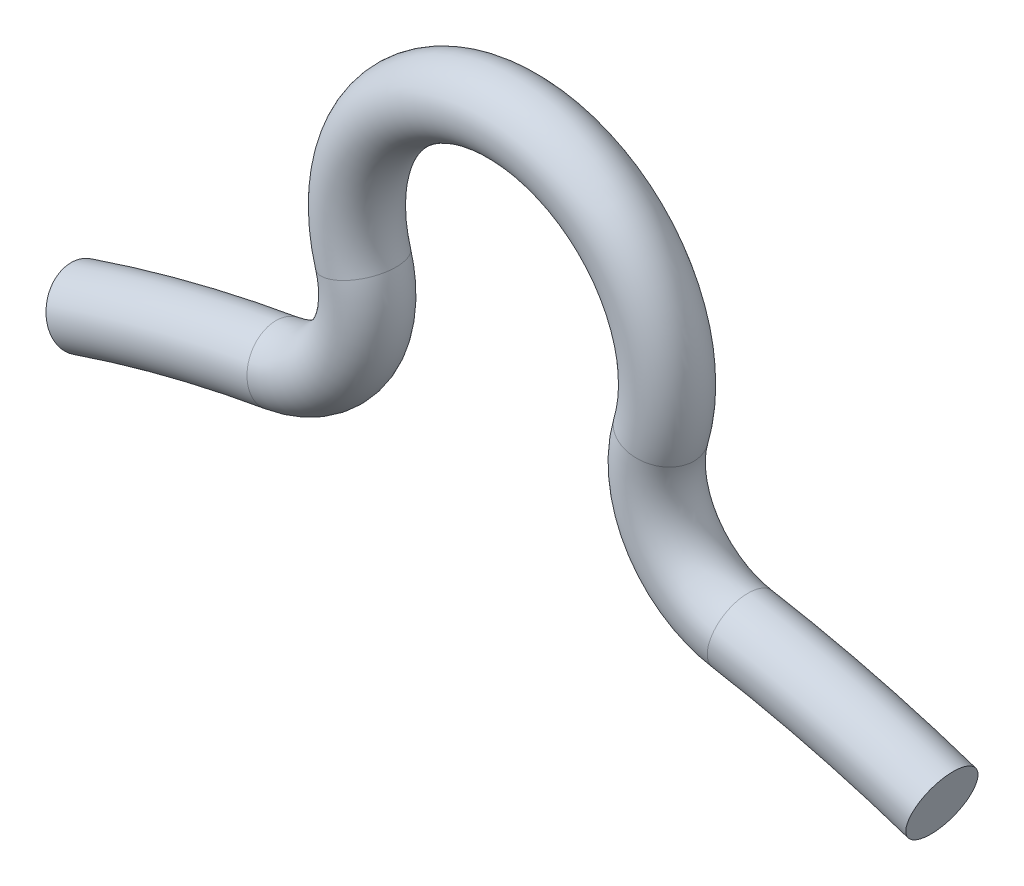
ISO-10303-21;
HEADER;
FILE_DESCRIPTION(('STEP AP214'),'2;1');
FILE_NAME('part.step','',(''),(''),'','','');
FILE_SCHEMA(('AUTOMOTIVE_DESIGN { 1 0 10303 214 1 1 1 1 }'));
ENDSEC;
DATA;
#1=APPLICATION_CONTEXT('core data for automotive mechanical design processes');
#2=APPLICATION_PROTOCOL_DEFINITION('international standard','automotive_design',2000,#1);
#3=PRODUCT_CONTEXT('',#1,'mechanical');
#4=PRODUCT('Part','Part','',(#3));
#5=PRODUCT_RELATED_PRODUCT_CATEGORY('part','',(#4));
#6=PRODUCT_DEFINITION_FORMATION('','',#4);
#7=PRODUCT_DEFINITION_CONTEXT('part definition',#1,'design');
#8=PRODUCT_DEFINITION('design','',#6,#7);
#9=PRODUCT_DEFINITION_SHAPE('','',#8);
#10=(LENGTH_UNIT() NAMED_UNIT(*) SI_UNIT(.MILLI.,.METRE.));
#11=(NAMED_UNIT(*) PLANE_ANGLE_UNIT() SI_UNIT($,.RADIAN.));
#12=(NAMED_UNIT(*) SI_UNIT($,.STERADIAN.) SOLID_ANGLE_UNIT());
#13=UNCERTAINTY_MEASURE_WITH_UNIT(LENGTH_MEASURE(1.E-05),#10,'distance_accuracy_value','');
#14=(GEOMETRIC_REPRESENTATION_CONTEXT(3) GLOBAL_UNCERTAINTY_ASSIGNED_CONTEXT((#13)) GLOBAL_UNIT_ASSIGNED_CONTEXT((#10,
#11,#12)) REPRESENTATION_CONTEXT('',''));
#15=CARTESIAN_POINT('',(0.,0.,0.));
#16=DIRECTION('',(0.,0.,1.));
#17=DIRECTION('',(1.,0.,0.));
#18=AXIS2_PLACEMENT_3D('',#15,#16,#17);
#19=CARTESIAN_POINT('',(0.,0.,0.));
#20=DIRECTION('',(0.,0.,-1.));
#21=DIRECTION('',(-1.,0.,0.));
#22=AXIS2_PLACEMENT_3D('',#19,#20,#21);
#23=TOROIDAL_SURFACE('',#22,390.,10.);
#24=CARTESIAN_POINT('',(66.9129094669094,384.216947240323,0.));
#25=DIRECTION('',(0.98517165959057,-0.171571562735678,0.));
#26=DIRECTION('',(0.171571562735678,0.98517165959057,0.));
#27=AXIS2_PLACEMENT_3D('',#24,#25,#26);
#28=CIRCLE('',#27,10.);
#29=CARTESIAN_POINT('',(68.628625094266,394.068663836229,0.));
#30=VERTEX_POINT('',#29);
#31=EDGE_CURVE('E37',#30,#30,#28,.T.);
#32=CARTESIAN_POINT('',(125.000000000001,369.425229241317,0.));
#33=DIRECTION('',(0.947244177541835,-0.320512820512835,0.));
#34=DIRECTION('',(0.320512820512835,0.947244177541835,0.));
#35=AXIS2_PLACEMENT_3D('',#32,#33,#34);
#36=CIRCLE('',#35,10.);
#37=CARTESIAN_POINT('',(128.205128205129,378.897671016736,0.));
#38=VERTEX_POINT('',#37);
#39=EDGE_CURVE('E10',#38,#38,#36,.T.);
#40=CARTESIAN_POINT('',(0.,0.,0.));
#41=DIRECTION('',(0.,0.,-1.));
#42=DIRECTION('',(-1.,0.,0.));
#43=AXIS2_PLACEMENT_3D('',#40,#41,#42);
#44=CIRCLE('',#43,400.);
#45=EDGE_CURVE('',#30,#38,#44,.T.);
#46=ORIENTED_EDGE('',*,*,#31,.T.);
#47=ORIENTED_EDGE('',*,*,#39,.F.);
#48=ORIENTED_EDGE('',*,*,#45,.T.);
#49=ORIENTED_EDGE('',*,*,#45,.F.);
#50=EDGE_LOOP('',(#46,#48,#47,#49));
#51=FACE_BOUND('',#50,.T.);
#52=ADVANCED_FACE('F31',(#51),#23,.T.);
#53=CARTESIAN_POINT('',(72.0600563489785,413.77209702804,0.));
#54=DIRECTION('',(0.,0.,1.));
#55=DIRECTION('',(1.,0.,0.));
#56=AXIS2_PLACEMENT_3D('',#53,#54,#55);
#57=TOROIDAL_SURFACE('',#56,30.0000000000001,10.);
#58=CARTESIAN_POINT('',(43.2724826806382,422.214584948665,0.));
#59=DIRECTION('',(-0.281416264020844,-0.959585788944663,0.));
#60=DIRECTION('',(0.959585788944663,-0.281416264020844,0.));
#61=AXIS2_PLACEMENT_3D('',#58,#59,#60);
#62=CIRCLE('',#61,10.);
#63=CARTESIAN_POINT('',(52.8683405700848,419.400422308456,0.));
#64=VERTEX_POINT('',#63);
#65=EDGE_CURVE('E41',#64,#64,#62,.T.);
#66=ORIENTED_EDGE('',*,*,#65,.T.);
#67=EDGE_LOOP('',(#66));
#68=FACE_BOUND('',#67,.T.);
#69=ORIENTED_EDGE('',*,*,#31,.F.);
#70=EDGE_LOOP('',(#69));
#71=FACE_BOUND('',#70,.T.);
#72=ADVANCED_FACE('F72',(#68,#71),#57,.T.);
#73=CARTESIAN_POINT('',(0.,434.905040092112,0.));
#74=DIRECTION('',(0.,0.,-1.));
#75=DIRECTION('',(-1.,0.,0.));
#76=AXIS2_PLACEMENT_3D('',#73,#74,#75);
#77=TOROIDAL_SURFACE('',#76,45.0949599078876,10.);
#78=CARTESIAN_POINT('',(-43.2724826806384,422.214584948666,0.));
#79=DIRECTION('',(-0.281416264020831,0.959585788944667,0.));
#80=DIRECTION('',(-0.959585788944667,-0.281416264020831,0.));
#81=AXIS2_PLACEMENT_3D('',#78,#79,#80);
#82=CIRCLE('',#81,10.);
#83=CARTESIAN_POINT('',(-52.8683405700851,419.400422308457,0.));
#84=VERTEX_POINT('',#83);
#85=EDGE_CURVE('E45',#84,#84,#82,.T.);
#86=CARTESIAN_POINT('',(0.,434.905040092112,0.));
#87=DIRECTION('',(0.,0.,-1.));
#88=DIRECTION('',(-1.,0.,0.));
#89=AXIS2_PLACEMENT_3D('',#86,#87,#88);
#90=CIRCLE('',#89,55.0949599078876);
#91=EDGE_CURVE('',#84,#64,#90,.T.);
#92=ORIENTED_EDGE('',*,*,#85,.T.);
#93=ORIENTED_EDGE('',*,*,#65,.F.);
#94=ORIENTED_EDGE('',*,*,#91,.T.);
#95=ORIENTED_EDGE('',*,*,#91,.F.);
#96=EDGE_LOOP('',(#92,#94,#93,#95));
#97=FACE_BOUND('',#96,.T.);
#98=ADVANCED_FACE('F76',(#97),#77,.T.);
#99=CARTESIAN_POINT('',(-72.0600563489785,413.77209702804,0.));
#100=DIRECTION('',(0.,0.,1.));
#101=DIRECTION('',(1.,0.,0.));
#102=AXIS2_PLACEMENT_3D('',#99,#100,#101);
#103=TOROIDAL_SURFACE('',#102,30.0000000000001,10.);
#104=CARTESIAN_POINT('',(-66.9129094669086,384.216947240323,0.));
#105=DIRECTION('',(0.985171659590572,0.171571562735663,0.));
#106=DIRECTION('',(-0.171571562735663,0.985171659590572,0.));
#107=AXIS2_PLACEMENT_3D('',#104,#105,#106);
#108=CIRCLE('',#107,10.);
#109=CARTESIAN_POINT('',(-68.6286250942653,394.068663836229,0.));
#110=VERTEX_POINT('',#109);
#111=EDGE_CURVE('E50',#110,#110,#108,.T.);
#112=ORIENTED_EDGE('',*,*,#111,.T.);
#113=EDGE_LOOP('',(#112));
#114=FACE_BOUND('',#113,.T.);
#115=ORIENTED_EDGE('',*,*,#85,.F.);
#116=EDGE_LOOP('',(#115));
#117=FACE_BOUND('',#116,.T.);
#118=ADVANCED_FACE('F67',(#114,#117),#103,.T.);
#119=CARTESIAN_POINT('',(0.,0.,0.));
#120=DIRECTION('',(0.,0.,1.));
#121=DIRECTION('',(1.,0.,0.));
#122=AXIS2_PLACEMENT_3D('',#119,#120,#121);
#123=TOROIDAL_SURFACE('',#122,390.,10.);
#124=CARTESIAN_POINT('',(-125.,369.425229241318,0.));
#125=DIRECTION('',(0.94724417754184,0.32051282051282,0.));
#126=DIRECTION('',(-0.32051282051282,0.94724417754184,0.));
#127=AXIS2_PLACEMENT_3D('',#124,#125,#126);
#128=CIRCLE('',#127,10.);
#129=CARTESIAN_POINT('',(-128.205128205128,378.897671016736,0.));
#130=VERTEX_POINT('',#129);
#131=EDGE_CURVE('E53',#130,#130,#128,.T.);
#132=CARTESIAN_POINT('',(0.,0.,0.));
#133=DIRECTION('',(0.,0.,1.));
#134=DIRECTION('',(1.,0.,0.));
#135=AXIS2_PLACEMENT_3D('',#132,#133,#134);
#136=CIRCLE('',#135,400.);
#137=EDGE_CURVE('',#110,#130,#136,.T.);
#138=ORIENTED_EDGE('',*,*,#111,.F.);
#139=ORIENTED_EDGE('',*,*,#131,.T.);
#140=ORIENTED_EDGE('',*,*,#137,.T.);
#141=ORIENTED_EDGE('',*,*,#137,.F.);
#142=EDGE_LOOP('',(#138,#140,#139,#141));
#143=FACE_BOUND('',#142,.T.);
#144=ADVANCED_FACE('F57',(#143),#123,.T.);
#145=CARTESIAN_POINT('',(125.000000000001,369.425229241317,0.));
#146=DIRECTION('',(0.947244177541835,-0.320512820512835,0.));
#147=DIRECTION('',(0.320512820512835,0.947244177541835,0.));
#148=AXIS2_PLACEMENT_3D('',#145,#146,#147);
#149=PLANE('',#148);
#150=ORIENTED_EDGE('',*,*,#39,.T.);
#151=EDGE_LOOP('',(#150));
#152=FACE_BOUND('',#151,.T.);
#153=ADVANCED_FACE('F61',(#152),#149,.T.);
#154=CARTESIAN_POINT('',(-125.,369.425229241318,0.));
#155=DIRECTION('',(0.94724417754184,0.32051282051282,0.));
#156=DIRECTION('',(-0.32051282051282,0.94724417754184,0.));
#157=AXIS2_PLACEMENT_3D('',#154,#155,#156);
#158=PLANE('',#157);
#159=ORIENTED_EDGE('',*,*,#131,.F.);
#160=EDGE_LOOP('',(#159));
#161=FACE_BOUND('',#160,.T.);
#162=ADVANCED_FACE('F59',(#161),#158,.F.);
#163=CLOSED_SHELL('',(#52,#72,#98,#118,#144,#153,#162));
#164=MANIFOLD_SOLID_BREP('B2',#163);
#165=ADVANCED_BREP_SHAPE_REPRESENTATION('',(#18,#164),#14);
#166=SHAPE_DEFINITION_REPRESENTATION(#9,#165);
ENDSEC;
END-ISO-10303-21;
